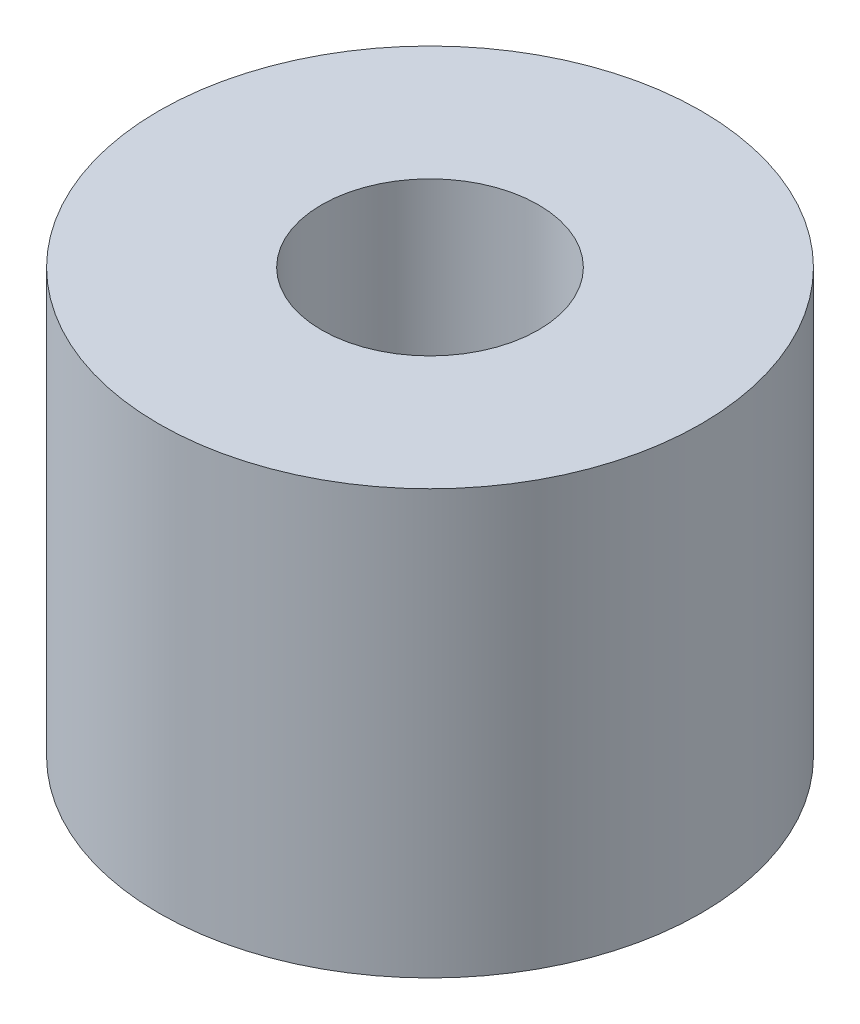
from build123d import *

# Parameters (mm, degrees)
SKETCH_1_R      = 4
SKETCH_1_R_2    = 1.6
EXTRUDE_1_DEPTH = 6.25


with BuildPart() as part:
    # Sketch 1 → Extrude 1 (new body)
    with BuildSketch(Plane(origin=(0, 0, 0), x_dir=(1, 0, 0), z_dir=(0, 1, 0))):
        with Locations(Location((0, 0, 0), (0, 0, 270))):
            Circle(SKETCH_1_R)
        with Locations(Location((0, 0, 0), (0, 0, 270))):
            Circle(SKETCH_1_R_2, mode=Mode.SUBTRACT)
    extrude(amount=EXTRUDE_1_DEPTH)


solid = part.part
